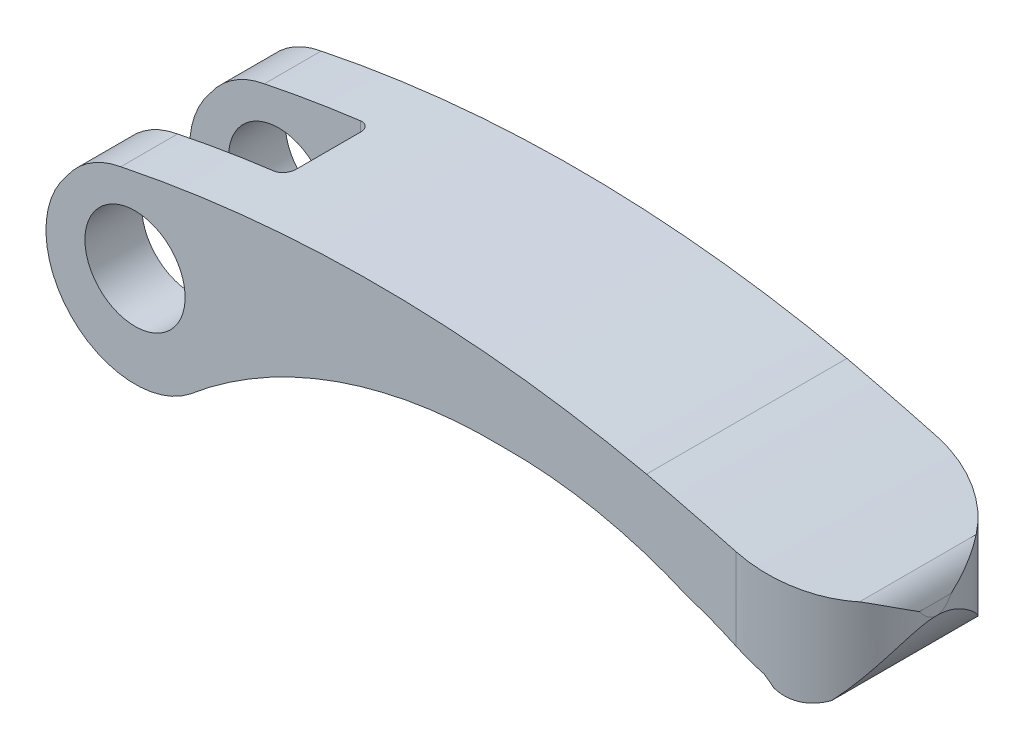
ISO-10303-21;
HEADER;
FILE_DESCRIPTION(('STEP AP214'),'2;1');
FILE_NAME('part.step','',(''),(''),'','','');
FILE_SCHEMA(('AUTOMOTIVE_DESIGN { 1 0 10303 214 1 1 1 1 }'));
ENDSEC;
DATA;
#1=APPLICATION_CONTEXT('core data for automotive mechanical design processes');
#2=APPLICATION_PROTOCOL_DEFINITION('international standard','automotive_design',2000,#1);
#3=PRODUCT_CONTEXT('',#1,'mechanical');
#4=PRODUCT('Part','Part','',(#3));
#5=PRODUCT_RELATED_PRODUCT_CATEGORY('part','',(#4));
#6=PRODUCT_DEFINITION_FORMATION('','',#4);
#7=PRODUCT_DEFINITION_CONTEXT('part definition',#1,'design');
#8=PRODUCT_DEFINITION('design','',#6,#7);
#9=PRODUCT_DEFINITION_SHAPE('','',#8);
#10=(LENGTH_UNIT() NAMED_UNIT(*) SI_UNIT(.MILLI.,.METRE.));
#11=(NAMED_UNIT(*) PLANE_ANGLE_UNIT() SI_UNIT($,.RADIAN.));
#12=(NAMED_UNIT(*) SI_UNIT($,.STERADIAN.) SOLID_ANGLE_UNIT());
#13=UNCERTAINTY_MEASURE_WITH_UNIT(LENGTH_MEASURE(1.E-05),#10,'distance_accuracy_value','');
#14=(GEOMETRIC_REPRESENTATION_CONTEXT(3) GLOBAL_UNCERTAINTY_ASSIGNED_CONTEXT((#13)) GLOBAL_UNIT_ASSIGNED_CONTEXT((#10,
#11,#12)) REPRESENTATION_CONTEXT('',''));
#15=CARTESIAN_POINT('',(0.,0.,0.));
#16=DIRECTION('',(0.,0.,1.));
#17=DIRECTION('',(1.,0.,0.));
#18=AXIS2_PLACEMENT_3D('',#15,#16,#17);
#19=CARTESIAN_POINT('',(49.9813614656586,-9.25441630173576,9.));
#20=DIRECTION('',(0.,0.,-1.));
#21=DIRECTION('',(-1.,0.,0.));
#22=AXIS2_PLACEMENT_3D('',#19,#20,#21);
#23=CYLINDRICAL_SURFACE('',#22,8.44721928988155);
#24=DIRECTION('',(0.,0.,-1.));
#25=VECTOR('',#24,1.);
#26=CARTESIAN_POINT('',(56.9117806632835,-4.42484039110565,9.));
#27=LINE('',#26,#25);
#28=CARTESIAN_POINT('',(56.9117806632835,-4.42484039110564,8.51595757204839));
#29=VERTEX_POINT('',#28);
#30=CARTESIAN_POINT('',(56.9117806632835,-4.42484039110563,-8.51595757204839));
#31=VERTEX_POINT('',#30);
#32=EDGE_CURVE('E374',#29,#31,#27,.T.);
#33=ORIENTED_EDGE('',*,*,#32,.F.);
#34=CARTESIAN_POINT('',(56.22613031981,-3.56597401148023,8.72034080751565));
#35=CARTESIAN_POINT('',(56.2880302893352,-3.63392767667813,8.70453904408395));
#36=CARTESIAN_POINT('',(56.3487729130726,-3.70283898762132,8.68833055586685));
#37=CARTESIAN_POINT('',(56.4678407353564,-3.84243815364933,8.65526287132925));
#38=CARTESIAN_POINT('',(56.5261684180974,-3.91312405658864,8.63840437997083));
#39=CARTESIAN_POINT('',(56.6404341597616,-4.05627700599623,8.60416555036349));
#40=CARTESIAN_POINT('',(56.6963722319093,-4.12874404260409,8.58678521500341));
#41=CARTESIAN_POINT('',(56.8058801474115,-4.2754758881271,8.55162832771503));
#42=CARTESIAN_POINT('',(56.8594474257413,-4.3497425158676,8.5338513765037));
#43=CARTESIAN_POINT('',(56.9117806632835,-4.42484039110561,8.51595757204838));
#44=B_SPLINE_CURVE_WITH_KNOTS('',3,(#34,#35,#36,#37,#38,#39,#40,#41,#42,#43),.UNSPECIFIED.,.F.,
.F.,(4,2,2,2,4),(0.,0.279790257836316,0.559285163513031,0.838778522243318,1.11856722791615),.UNSPECIFIED.);
#45=CARTESIAN_POINT('',(56.22613031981,-3.56597401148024,8.72034080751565));
#46=VERTEX_POINT('',#45);
#47=EDGE_CURVE('E292',#46,#29,#44,.T.);
#48=ORIENTED_EDGE('',*,*,#47,.F.);
#49=DIRECTION('',(0.,0.,-1.));
#50=VECTOR('',#49,1.);
#51=CARTESIAN_POINT('',(56.22613031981,-3.56597401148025,9.));
#52=LINE('',#51,#50);
#53=CARTESIAN_POINT('',(56.22613031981,-3.56597401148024,-8.72034080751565));
#54=VERTEX_POINT('',#53);
#55=EDGE_CURVE('E351',#46,#54,#52,.T.);
#56=ORIENTED_EDGE('',*,*,#55,.T.);
#57=CARTESIAN_POINT('',(56.9117806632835,-4.42484039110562,-8.51595757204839));
#58=CARTESIAN_POINT('',(56.8594474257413,-4.3497425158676,-8.53385137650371));
#59=CARTESIAN_POINT('',(56.8058801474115,-4.2754758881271,-8.55162832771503));
#60=CARTESIAN_POINT('',(56.6963722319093,-4.12874404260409,-8.58678521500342));
#61=CARTESIAN_POINT('',(56.6404341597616,-4.05627700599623,-8.6041655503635));
#62=CARTESIAN_POINT('',(56.5261684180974,-3.91312405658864,-8.63840437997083));
#63=CARTESIAN_POINT('',(56.4678407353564,-3.84243815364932,-8.65526287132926));
#64=CARTESIAN_POINT('',(56.3487729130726,-3.70283898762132,-8.68833055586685));
#65=CARTESIAN_POINT('',(56.2880302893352,-3.63392767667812,-8.70453904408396));
#66=CARTESIAN_POINT('',(56.22613031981,-3.56597401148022,-8.72034080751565));
#67=B_SPLINE_CURVE_WITH_KNOTS('',3,(#57,#58,#59,#60,#61,#62,#63,#64,#65,#66),.UNSPECIFIED.,.F.,
.F.,(4,2,2,2,4),(0.,0.279788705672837,0.559282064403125,0.838776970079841,1.11856722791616),.UNSPECIFIED.);
#68=EDGE_CURVE('E18',#31,#54,#67,.T.);
#69=ORIENTED_EDGE('',*,*,#68,.F.);
#70=EDGE_LOOP('',(#33,#48,#56,#69));
#71=FACE_BOUND('',#70,.T.);
#72=ADVANCED_FACE('F14',(#71),#23,.F.);
#73=CARTESIAN_POINT('',(63.,0.,9.));
#74=DIRECTION('',(-0.993149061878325,-0.116854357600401,0.));
#75=DIRECTION('',(0.116854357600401,-0.993149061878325,0.));
#76=AXIS2_PLACEMENT_3D('',#73,#74,#75);
#77=PLANE('',#76);
#78=CARTESIAN_POINT('',(54.,76.4912985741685,0.));
#79=DIRECTION('',(-0.993149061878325,-0.116854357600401,0.));
#80=DIRECTION('',(0.116854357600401,-0.993149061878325,0.));
#81=AXIS2_PLACEMENT_3D('',#78,#79,#80);
#82=ELLIPSE('',#81,77.0189506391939,9.);
#83=CARTESIAN_POINT('',(62.8855753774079,0.972498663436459,-1.43057688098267));
#84=VERTEX_POINT('',#83);
#85=CARTESIAN_POINT('',(63.,0.,0.));
#86=VERTEX_POINT('',#85);
#87=EDGE_CURVE('E356',#84,#86,#82,.T.);
#88=ORIENTED_EDGE('',*,*,#87,.F.);
#89=DIRECTION('',(0.,0.,-1.));
#90=VECTOR('',#89,1.);
#91=CARTESIAN_POINT('',(62.8855753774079,0.972498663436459,9.));
#92=LINE('',#91,#90);
#93=CARTESIAN_POINT('',(62.8855753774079,0.972498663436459,1.43057688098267));
#94=VERTEX_POINT('',#93);
#95=EDGE_CURVE('E366',#94,#84,#92,.T.);
#96=ORIENTED_EDGE('',*,*,#95,.F.);
#97=CARTESIAN_POINT('',(54.,76.4912985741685,0.));
#98=DIRECTION('',(-0.993149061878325,-0.116854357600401,0.));
#99=DIRECTION('',(0.116854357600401,-0.993149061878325,0.));
#100=AXIS2_PLACEMENT_3D('',#97,#98,#99);
#101=ELLIPSE('',#100,77.0189506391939,9.);
#102=EDGE_CURVE('E549',#86,#94,#101,.T.);
#103=ORIENTED_EDGE('',*,*,#102,.F.);
#104=EDGE_LOOP('',(#88,#96,#103));
#105=FACE_BOUND('',#104,.T.);
#106=ADVANCED_FACE('F550',(#105),#77,.F.);
#107=CARTESIAN_POINT('',(49.7035415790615,4.75137276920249,9.));
#108=DIRECTION('',(0.,0.,-1.));
#109=DIRECTION('',(-1.,0.,0.));
#110=AXIS2_PLACEMENT_3D('',#107,#108,#109);
#111=CYLINDRICAL_SURFACE('',#110,14.1198919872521);
#112=CARTESIAN_POINT('',(63.,0.,0.));
#113=CARTESIAN_POINT('',(63.0000267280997,0.000117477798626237,-0.110956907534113));
#114=CARTESIAN_POINT('',(62.9979493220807,-0.00573911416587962,-0.221828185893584));
#115=CARTESIAN_POINT('',(62.9898069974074,-0.0284547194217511,-0.44196657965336));
#116=CARTESIAN_POINT('',(62.9837540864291,-0.0452805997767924,-0.551237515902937));
#117=CARTESIAN_POINT('',(62.9680464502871,-0.0885386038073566,-0.765144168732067));
#118=CARTESIAN_POINT('',(62.9584703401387,-0.114760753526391,-0.869829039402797));
#119=CARTESIAN_POINT('',(62.93599936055,-0.175539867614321,-1.07643767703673));
#120=CARTESIAN_POINT('',(62.9231017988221,-0.210103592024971,-1.17835912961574));
#121=CARTESIAN_POINT('',(62.8876217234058,-0.303812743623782,-1.42554849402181));
#122=CARTESIAN_POINT('',(62.8633189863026,-0.366933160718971,-1.56905802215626));
#123=CARTESIAN_POINT('',(62.8090729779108,-0.50427677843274,-1.84950341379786));
#124=CARTESIAN_POINT('',(62.7791266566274,-0.578505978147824,-1.98643567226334));
#125=CARTESIAN_POINT('',(62.7138303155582,-0.735984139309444,-2.25578765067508));
#126=CARTESIAN_POINT('',(62.6784228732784,-0.819325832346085,-2.38813859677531));
#127=CARTESIAN_POINT('',(62.6028683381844,-0.992112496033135,-2.64743228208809));
#128=CARTESIAN_POINT('',(62.5627191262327,-1.08156018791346,-2.77437256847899));
#129=CARTESIAN_POINT('',(62.4739717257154,-1.27354813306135,-3.03521604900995));
#130=CARTESIAN_POINT('',(62.4249337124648,-1.37652711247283,-3.16864483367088));
#131=CARTESIAN_POINT('',(62.3217732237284,-1.58623438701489,-3.43043137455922));
#132=CARTESIAN_POINT('',(62.2676513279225,-1.69296225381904,-3.55878970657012));
#133=CARTESIAN_POINT('',(62.0977429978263,-2.01727327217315,-3.93742227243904));
#134=CARTESIAN_POINT('',(61.9744973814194,-2.23880004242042,-4.18101263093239));
#135=CARTESIAN_POINT('',(61.7090546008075,-2.68545895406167,-4.65223132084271));
#136=CARTESIAN_POINT('',(61.5669203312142,-2.91057703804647,-4.87990895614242));
#137=CARTESIAN_POINT('',(61.2633825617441,-3.36128284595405,-5.32117511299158));
#138=CARTESIAN_POINT('',(61.1019931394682,-3.58687010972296,-5.53477375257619));
#139=CARTESIAN_POINT('',(60.811375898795,-3.96792672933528,-5.88559206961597));
#140=CARTESIAN_POINT('',(60.6871788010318,-4.12397275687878,-6.02637765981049));
#141=CARTESIAN_POINT('',(60.4292706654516,-4.43397973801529,-6.30077747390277));
#142=CARTESIAN_POINT('',(60.2955725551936,-4.5879431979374,-6.43440102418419));
#143=CARTESIAN_POINT('',(60.1569711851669,-4.74057956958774,-6.56442730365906));
#144=B_SPLINE_CURVE_WITH_KNOTS('',3,(#112,#113,#114,#115,#116,#117,#118,#119,#120,#121,#122,
#123,#124,#125,#126,#127,#128,#129,#130,#131,#132,#133,#134,#135,#136,#137,#138,#139,#140,#141,
#142,#143),.UNSPECIFIED.,.F.,.F.,(4,2,2,2,2,2,2,2,2,2,2,2,2,2,2,4),(0.,0.332560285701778,
0.664120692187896,0.988691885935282,1.31352700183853,1.78862696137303,2.26398442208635,
2.74473198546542,3.22569521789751,3.75207544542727,4.27839572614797,5.33197739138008,
6.3821349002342,7.4315292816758,8.16361869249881,8.89473038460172),.UNSPECIFIED.);
#145=CARTESIAN_POINT('',(60.1569711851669,-4.74057956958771,-6.56442730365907));
#146=VERTEX_POINT('',#145);
#147=EDGE_CURVE('E315',#86,#146,#144,.T.);
#148=ORIENTED_EDGE('',*,*,#147,.F.);
#149=CARTESIAN_POINT('',(60.1569711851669,-4.74057956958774,6.56442730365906));
#150=CARTESIAN_POINT('',(60.2648988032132,-4.62172155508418,6.46318876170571));
#151=CARTESIAN_POINT('',(60.3698570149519,-4.50205633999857,6.35975166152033));
#152=CARTESIAN_POINT('',(60.5738919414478,-4.26149017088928,6.14862005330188));
#153=CARTESIAN_POINT('',(60.672969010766,-4.14058929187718,6.04092580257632));
#154=CARTESIAN_POINT('',(60.8654211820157,-3.89777824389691,5.82128271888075));
#155=CARTESIAN_POINT('',(60.9587896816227,-3.77586708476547,5.70932919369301));
#156=CARTESIAN_POINT('',(61.1397517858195,-3.53159614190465,5.48134230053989));
#157=CARTESIAN_POINT('',(61.2273453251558,-3.40923635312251,5.36530888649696));
#158=CARTESIAN_POINT('',(61.4824668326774,-3.04078212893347,5.009811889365));
#159=CARTESIAN_POINT('',(61.6413330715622,-2.79458751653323,4.76409680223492));
#160=CARTESIAN_POINT('',(61.8623108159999,-2.4288794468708,4.38242055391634));
#161=CARTESIAN_POINT('',(61.9330682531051,-2.30760268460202,4.2530437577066));
#162=CARTESIAN_POINT('',(62.0688108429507,-2.06702226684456,3.98952049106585));
#163=CARTESIAN_POINT('',(62.1337968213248,-1.94771833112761,3.85537470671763));
#164=CARTESIAN_POINT('',(62.2480848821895,-1.73078334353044,3.6034803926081));
#165=CARTESIAN_POINT('',(62.2982410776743,-1.63271166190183,3.48649863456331));
#166=CARTESIAN_POINT('',(62.3943070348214,-1.43954423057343,3.24839835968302));
#167=CARTESIAN_POINT('',(62.4402169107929,-1.34444840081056,3.12727995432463));
#168=CARTESIAN_POINT('',(62.5276913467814,-1.15820564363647,2.88022280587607));
#169=CARTESIAN_POINT('',(62.5692501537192,-1.06706403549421,2.75427797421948));
#170=CARTESIAN_POINT('',(62.6476861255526,-0.890420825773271,2.49711281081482));
#171=CARTESIAN_POINT('',(62.6845640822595,-0.804918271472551,2.36589337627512));
#172=CARTESIAN_POINT('',(62.7722898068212,-0.596332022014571,2.02320972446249));
#173=CARTESIAN_POINT('',(62.8195970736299,-0.478588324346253,1.80746967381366));
#174=CARTESIAN_POINT('',(62.8994452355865,-0.273723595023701,1.3604234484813));
#175=CARTESIAN_POINT('',(62.9320909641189,-0.186386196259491,1.12924181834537));
#176=CARTESIAN_POINT('',(62.9701104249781,-0.0830114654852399,0.746989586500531));
#177=CARTESIAN_POINT('',(62.9811652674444,-0.0524340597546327,0.600504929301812));
#178=CARTESIAN_POINT('',(62.9923858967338,-0.0212660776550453,0.37765647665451));
#179=CARTESIAN_POINT('',(62.9952330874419,-0.0133240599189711,0.302421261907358));
#180=CARTESIAN_POINT('',(62.999043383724,-0.00267773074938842,0.151466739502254));
#181=CARTESIAN_POINT('',(63.000004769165,2.17987379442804E-05,0.0757470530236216));
#182=CARTESIAN_POINT('',(63.,0.,0.));
#183=B_SPLINE_CURVE_WITH_KNOTS('',3,(#149,#150,#151,#152,#153,#154,#155,#156,#157,#158,#159,
#160,#161,#162,#163,#164,#165,#166,#167,#168,#169,#170,#171,#172,#173,#174,#175,#176,#177,#178,
#179,#180,#181,#182),.UNSPECIFIED.,.F.,.F.,(4,2,2,2,2,2,2,2,2,2,2,2,2,2,2,2,4),(0.,
0.569352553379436,1.13867074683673,1.70863540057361,2.27860649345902,3.42449115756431,
3.99715922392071,4.5697452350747,5.05167084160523,5.53358347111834,6.01612545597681,
6.49858570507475,7.24763397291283,7.99123760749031,8.43996362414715,8.6668942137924,
8.89403170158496),.UNSPECIFIED.);
#184=CARTESIAN_POINT('',(60.1569711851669,-4.74057956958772,6.56442730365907));
#185=VERTEX_POINT('',#184);
#186=EDGE_CURVE('E278',#185,#86,#183,.T.);
#187=ORIENTED_EDGE('',*,*,#186,.F.);
#188=DIRECTION('',(0.,0.,-1.));
#189=VECTOR('',#188,1.);
#190=CARTESIAN_POINT('',(60.1569711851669,-4.74057956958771,9.));
#191=LINE('',#190,#189);
#192=EDGE_CURVE('E368',#146,#185,#191,.F.);
#193=ORIENTED_EDGE('',*,*,#192,.F.);
#194=EDGE_LOOP('',(#148,#187,#193));
#195=FACE_BOUND('',#194,.T.);
#196=ADVANCED_FACE('F302',(#195),#111,.T.);
#197=CARTESIAN_POINT('',(58.7820309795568,-2.03729308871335,9.));
#198=DIRECTION('',(0.,0.,-1.));
#199=DIRECTION('',(-1.,0.,0.));
#200=AXIS2_PLACEMENT_3D('',#197,#198,#199);
#201=CYLINDRICAL_SURFACE('',#200,3.03285646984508);
#202=ORIENTED_EDGE('',*,*,#192,.T.);
#203=CARTESIAN_POINT('',(56.9117806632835,-4.42484039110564,8.51595757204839));
#204=CARTESIAN_POINT('',(56.9794883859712,-4.47789832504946,8.49281615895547));
#205=CARTESIAN_POINT('',(57.0491243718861,-4.52777886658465,8.46809551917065));
#206=CARTESIAN_POINT('',(57.1914560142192,-4.62099135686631,8.41548101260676));
#207=CARTESIAN_POINT('',(57.2641500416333,-4.66432673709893,8.38758882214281));
#208=CARTESIAN_POINT('',(57.4114518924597,-4.74408286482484,8.32876062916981));
#209=CARTESIAN_POINT('',(57.4860464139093,-4.78054169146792,8.29784292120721));
#210=CARTESIAN_POINT('',(57.6367927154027,-4.8468189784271,8.23289096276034));
#211=CARTESIAN_POINT('',(57.7129446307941,-4.87663685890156,8.19885644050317));
#212=CARTESIAN_POINT('',(57.9424032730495,-4.9560860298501,8.09232440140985));
#213=CARTESIAN_POINT('',(58.0970942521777,-4.99591520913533,8.01524827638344));
#214=CARTESIAN_POINT('',(58.4050762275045,-5.05071083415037,7.85022043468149));
#215=CARTESIAN_POINT('',(58.5583652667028,-5.06564662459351,7.76225545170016));
#216=CARTESIAN_POINT('',(58.8741600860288,-5.07324306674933,7.56835917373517));
#217=CARTESIAN_POINT('',(59.0361529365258,-5.06364638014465,7.46151464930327));
#218=CARTESIAN_POINT('',(59.3507814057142,-5.02057826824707,7.23921985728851));
#219=CARTESIAN_POINT('',(59.5034119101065,-4.98709391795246,7.12376496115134));
#220=CARTESIAN_POINT('',(59.7392059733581,-4.91664154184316,6.93358396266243));
#221=CARTESIAN_POINT('',(59.8259954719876,-4.88627357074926,6.86078317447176));
#222=CARTESIAN_POINT('',(59.99492442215,-4.81854048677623,6.7136727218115));
#223=CARTESIAN_POINT('',(60.0770783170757,-4.78119887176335,6.6393688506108));
#224=CARTESIAN_POINT('',(60.1569711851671,-4.74057956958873,6.56442730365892));
#225=B_SPLINE_CURVE_WITH_KNOTS('',3,(#203,#204,#205,#206,#207,#208,#209,#210,#211,#212,#213,
#214,#215,#216,#217,#218,#219,#220,#221,#222,#223,#224),.UNSPECIFIED.,.F.,.F.,(4,2,2,2,2,2,2,2,
2,2,4),(0.,0.267120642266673,0.534100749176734,0.799556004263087,1.06503442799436,
1.59463706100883,2.12489139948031,2.70565511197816,3.28673329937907,3.63829322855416,
3.98868926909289),.UNSPECIFIED.);
#226=EDGE_CURVE('E285',#29,#185,#225,.T.);
#227=ORIENTED_EDGE('',*,*,#226,.F.);
#228=ORIENTED_EDGE('',*,*,#32,.T.);
#229=CARTESIAN_POINT('',(60.1569711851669,-4.74057956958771,-6.56442730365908));
#230=CARTESIAN_POINT('',(60.0693558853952,-4.78512508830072,-6.64662261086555));
#231=CARTESIAN_POINT('',(59.9789806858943,-4.82574523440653,-6.72807214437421));
#232=CARTESIAN_POINT('',(59.7928861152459,-4.89848441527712,-6.88894485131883));
#233=CARTESIAN_POINT('',(59.6971585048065,-4.93058988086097,-6.96836461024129));
#234=CARTESIAN_POINT('',(59.5001551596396,-4.9856880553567,-7.12490213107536));
#235=CARTESIAN_POINT('',(59.3988464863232,-5.00861812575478,-7.20200085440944));
#236=CARTESIAN_POINT('',(59.1919343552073,-5.04415521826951,-7.35256410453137));
#237=CARTESIAN_POINT('',(59.0863339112,-5.05676935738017,-7.42603110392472));
#238=CARTESIAN_POINT('',(58.8143342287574,-5.07445101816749,-7.60664557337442));
#239=CARTESIAN_POINT('',(58.6454383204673,-5.07194958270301,-7.71095193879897));
#240=CARTESIAN_POINT('',(58.3038123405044,-5.03711095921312,-7.90669554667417));
#241=CARTESIAN_POINT('',(58.1310943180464,-5.00485726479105,-7.99816797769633));
#242=CARTESIAN_POINT('',(57.8071297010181,-4.91352546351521,-8.1568648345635));
#243=CARTESIAN_POINT('',(57.6556915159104,-4.85794635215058,-8.22566688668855));
#244=CARTESIAN_POINT('',(57.4338549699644,-4.75525287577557,-8.3195639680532));
#245=CARTESIAN_POINT('',(57.3608178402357,-4.717815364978,-8.34930429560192));
#246=CARTESIAN_POINT('',(57.2171599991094,-4.63656011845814,-8.40570115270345));
#247=CARTESIAN_POINT('',(57.146537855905,-4.59274624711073,-8.43235953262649));
#248=CARTESIAN_POINT('',(57.0493097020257,-4.52668248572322,-8.46773961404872));
#249=CARTESIAN_POINT('',(57.0213852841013,-4.50701319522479,-8.47774094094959));
#250=CARTESIAN_POINT('',(56.9661336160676,-4.4666762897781,-8.49722938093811));
#251=CARTESIAN_POINT('',(56.9388057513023,-4.44600978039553,-8.50671703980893));
#252=CARTESIAN_POINT('',(56.9117806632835,-4.42484039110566,-8.5159575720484));
#253=B_SPLINE_CURVE_WITH_KNOTS('',3,(#229,#230,#231,#232,#233,#234,#235,#236,#237,#238,#239,
#240,#241,#242,#243,#244,#245,#246,#247,#248,#249,#250,#251,#252),.UNSPECIFIED.,.F.,.F.,(4,2,2,
2,2,2,2,2,2,2,2,4),(0.,0.384356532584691,0.769321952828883,1.15687236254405,1.54415517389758,
2.13717775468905,2.72854118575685,3.25211147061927,3.51373609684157,3.77520282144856,
3.88195639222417,3.98859421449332),.UNSPECIFIED.);
#254=EDGE_CURVE('E307',#146,#31,#253,.T.);
#255=ORIENTED_EDGE('',*,*,#254,.F.);
#256=EDGE_LOOP('',(#202,#227,#228,#255));
#257=FACE_BOUND('',#256,.T.);
#258=ADVANCED_FACE('F297',(#257),#201,.T.);
#259=CARTESIAN_POINT('',(0.,0.,18.));
#260=DIRECTION('',(0.,0.,-1.));
#261=DIRECTION('',(-1.,0.,0.));
#262=AXIS2_PLACEMENT_3D('',#259,#260,#261);
#263=CYLINDRICAL_SURFACE('',#262,4.5);
#264=CARTESIAN_POINT('',(0.,0.,3.9));
#265=DIRECTION('',(0.,0.,-1.));
#266=DIRECTION('',(-1.,0.,0.));
#267=AXIS2_PLACEMENT_3D('',#264,#265,#266);
#268=CIRCLE('',#267,4.5);
#269=CARTESIAN_POINT('',(-4.5,0.,3.9));
#270=VERTEX_POINT('',#269);
#271=EDGE_CURVE('E197',#270,#270,#268,.T.);
#272=ORIENTED_EDGE('',*,*,#271,.T.);
#273=EDGE_LOOP('',(#272));
#274=FACE_BOUND('',#273,.T.);
#275=CARTESIAN_POINT('',(0.,0.,9.));
#276=DIRECTION('',(0.,0.,-1.));
#277=DIRECTION('',(-1.,0.,0.));
#278=AXIS2_PLACEMENT_3D('',#275,#276,#277);
#279=CIRCLE('',#278,4.5);
#280=CARTESIAN_POINT('',(-4.5,0.,9.));
#281=VERTEX_POINT('',#280);
#282=EDGE_CURVE('E163',#281,#281,#279,.T.);
#283=ORIENTED_EDGE('',*,*,#282,.F.);
#284=EDGE_LOOP('',(#283));
#285=FACE_BOUND('',#284,.T.);
#286=ADVANCED_FACE('F301',(#274,#285),#263,.F.);
#287=CARTESIAN_POINT('',(0.000156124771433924,-0.999995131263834,9.));
#288=DIRECTION('',(0.,0.,-1.));
#289=DIRECTION('',(-1.,0.,0.));
#290=AXIS2_PLACEMENT_3D('',#287,#288,#289);
#291=CYLINDRICAL_SURFACE('',#290,8.);
#292=DIRECTION('',(0.,0.,-1.));
#293=VECTOR('',#292,1.);
#294=CARTESIAN_POINT('',(4.96664216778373,-7.27167882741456,9.));
#295=LINE('',#294,#293);
#296=CARTESIAN_POINT('',(4.96664216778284,-7.27167882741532,3.9));
#297=VERTEX_POINT('',#296);
#298=CARTESIAN_POINT('',(4.96664216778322,-7.271678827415,9.));
#299=VERTEX_POINT('',#298);
#300=EDGE_CURVE('E365',#297,#299,#295,.F.);
#301=ORIENTED_EDGE('',*,*,#300,.T.);
#302=CARTESIAN_POINT('',(0.000156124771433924,-0.999995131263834,9.));
#303=DIRECTION('',(0.,0.,-1.));
#304=DIRECTION('',(-1.,0.,0.));
#305=AXIS2_PLACEMENT_3D('',#302,#303,#304);
#306=CIRCLE('',#305,8.);
#307=CARTESIAN_POINT('',(-6.09273550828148,4.18427642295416,9.));
#308=VERTEX_POINT('',#307);
#309=EDGE_CURVE('E175',#308,#299,#306,.F.);
#310=ORIENTED_EDGE('',*,*,#309,.F.);
#311=DIRECTION('',(0.,0.,-1.));
#312=VECTOR('',#311,1.);
#313=CARTESIAN_POINT('',(-6.09273550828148,4.18427642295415,9.));
#314=LINE('',#313,#312);
#315=CARTESIAN_POINT('',(-6.09273550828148,4.18427642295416,3.9));
#316=VERTEX_POINT('',#315);
#317=EDGE_CURVE('E191',#316,#308,#314,.F.);
#318=ORIENTED_EDGE('',*,*,#317,.F.);
#319=CARTESIAN_POINT('',(0.000156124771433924,-0.999995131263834,3.9));
#320=DIRECTION('',(0.,0.,-1.));
#321=DIRECTION('',(-1.,0.,0.));
#322=AXIS2_PLACEMENT_3D('',#319,#320,#321);
#323=CIRCLE('',#322,8.);
#324=EDGE_CURVE('E133',#316,#297,#323,.F.);
#325=ORIENTED_EDGE('',*,*,#324,.T.);
#326=EDGE_LOOP('',(#301,#310,#318,#325));
#327=FACE_BOUND('',#326,.T.);
#328=ADVANCED_FACE('F510',(#327),#291,.T.);
#329=CARTESIAN_POINT('',(59.9754791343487,0.140510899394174,9.));
#330=DIRECTION('',(0.,0.,-1.));
#331=DIRECTION('',(-1.,0.,0.));
#332=AXIS2_PLACEMENT_3D('',#329,#330,#331);
#333=CYLINDRICAL_SURFACE('',#332,3.02669188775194);
#334=DIRECTION('',(0.,0.,-1.));
#335=VECTOR('',#334,1.);
#336=CARTESIAN_POINT('',(61.3171374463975,2.8535934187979,9.));
#337=LINE('',#336,#335);
#338=CARTESIAN_POINT('',(61.3171374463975,2.85359341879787,5.24018125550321));
#339=VERTEX_POINT('',#338);
#340=CARTESIAN_POINT('',(61.3171374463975,2.85359341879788,-5.24018125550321));
#341=VERTEX_POINT('',#340);
#342=EDGE_CURVE('E170',#339,#341,#337,.T.);
#343=ORIENTED_EDGE('',*,*,#342,.F.);
#344=CARTESIAN_POINT('',(62.8855753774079,0.972498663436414,1.43057688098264));
#345=CARTESIAN_POINT('',(62.8497139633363,1.09787880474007,1.65311426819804));
#346=CARTESIAN_POINT('',(62.8054396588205,1.22211335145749,1.87502386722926));
#347=CARTESIAN_POINT('',(62.6995216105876,1.46650183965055,2.31738970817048));
#348=CARTESIAN_POINT('',(62.637851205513,1.58664919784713,2.5378431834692));
#349=CARTESIAN_POINT('',(62.49810902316,1.81834721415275,2.9720470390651));
#350=CARTESIAN_POINT('',(62.4203879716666,1.9300213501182,3.18584351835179));
#351=CARTESIAN_POINT('',(62.2473450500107,2.14513949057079,3.61023446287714));
#352=CARTESIAN_POINT('',(62.1520367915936,2.24858977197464,3.82083126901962));
#353=CARTESIAN_POINT('',(61.9446195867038,2.44340091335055,4.2350774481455));
#354=CARTESIAN_POINT('',(61.8327675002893,2.53491214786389,4.43878296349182));
#355=CARTESIAN_POINT('',(61.6507302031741,2.66240606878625,4.74134671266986));
#356=CARTESIAN_POINT('',(61.5873275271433,2.70345229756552,4.84218989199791));
#357=CARTESIAN_POINT('',(61.4557910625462,2.78160636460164,5.04237297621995));
#358=CARTESIAN_POINT('',(61.3876551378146,2.81871240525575,5.14171217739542));
#359=CARTESIAN_POINT('',(61.3171374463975,2.85359341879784,5.24018125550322));
#360=B_SPLINE_CURVE_WITH_KNOTS('',3,(#344,#345,#346,#347,#348,#349,#350,#351,#352,#353,#354,
#355,#356,#357,#358,#359),.UNSPECIFIED.,.F.,.F.,(4,2,2,2,2,2,2,4),(0.,0.773764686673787,
1.54872175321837,2.30826061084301,3.06721406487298,3.81542648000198,4.19326204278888,
4.57126924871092),.UNSPECIFIED.);
#361=EDGE_CURVE('E152',#94,#339,#360,.T.);
#362=ORIENTED_EDGE('',*,*,#361,.F.);
#363=ORIENTED_EDGE('',*,*,#95,.T.);
#364=CARTESIAN_POINT('',(61.3171374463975,2.85359341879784,-5.24018125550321));
#365=CARTESIAN_POINT('',(61.3802004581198,2.82240209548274,-5.15212215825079));
#366=CARTESIAN_POINT('',(61.4413601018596,2.78942759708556,-5.063364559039));
#367=CARTESIAN_POINT('',(61.5598970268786,2.72027778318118,-4.88461435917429));
#368=CARTESIAN_POINT('',(61.6172753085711,2.68410332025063,-4.79462209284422));
#369=CARTESIAN_POINT('',(61.7836655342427,2.57140847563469,-4.52322283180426));
#370=CARTESIAN_POINT('',(61.8871118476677,2.49062594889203,-4.3401423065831));
#371=CARTESIAN_POINT('',(62.0779459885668,2.32145133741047,-3.97351744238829));
#372=CARTESIAN_POINT('',(62.1655599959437,2.23319828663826,-3.79002529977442));
#373=CARTESIAN_POINT('',(62.3271338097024,2.04983468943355,-3.42045672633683));
#374=CARTESIAN_POINT('',(62.4010904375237,1.95472255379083,-3.23437970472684));
#375=CARTESIAN_POINT('',(62.5636718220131,1.71859249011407,-2.78256725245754));
#376=CARTESIAN_POINT('',(62.6456530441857,1.57489984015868,-2.51581049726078));
#377=CARTESIAN_POINT('',(62.7497539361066,1.3533657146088,-2.11220495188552));
#378=CARTESIAN_POINT('',(62.7814334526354,1.27807934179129,-1.9763139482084));
#379=CARTESIAN_POINT('',(62.8383282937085,1.12617637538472,-1.70390289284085));
#380=CARTESIAN_POINT('',(62.8635429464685,1.04955964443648,-1.56738277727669));
#381=CARTESIAN_POINT('',(62.8855753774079,0.972498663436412,-1.43057688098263));
#382=B_SPLINE_CURVE_WITH_KNOTS('',3,(#364,#365,#366,#367,#368,#369,#370,#371,#372,#373,#374,
#375,#376,#377,#378,#379,#380,#381),.UNSPECIFIED.,.F.,.F.,(4,2,2,2,2,2,2,2,4),(0.,
0.338063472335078,0.676037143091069,1.35102365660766,2.01543605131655,2.68000288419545,
3.62027428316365,4.0958120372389,4.57139918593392),.UNSPECIFIED.);
#383=EDGE_CURVE('E337',#341,#84,#382,.T.);
#384=ORIENTED_EDGE('',*,*,#383,.F.);
#385=EDGE_LOOP('',(#343,#362,#363,#384));
#386=FACE_BOUND('',#385,.T.);
#387=ADVANCED_FACE('F255',(#386),#333,.T.);
#388=CARTESIAN_POINT('',(54.,15.75,0.));
#389=DIRECTION('',(0.,-1.,0.));
#390=DIRECTION('',(0.,0.,-1.));
#391=AXIS2_PLACEMENT_3D('',#388,#389,#390);
#392=CYLINDRICAL_SURFACE('',#391,9.);
#393=CARTESIAN_POINT('',(54.,4.96493342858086,9.));
#394=CARTESIAN_POINT('',(54.261594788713,4.89424655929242,9.00002182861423));
#395=CARTESIAN_POINT('',(54.5230523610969,4.82307785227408,8.98859569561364));
#396=CARTESIAN_POINT('',(55.0438651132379,4.68030745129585,8.94307376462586));
#397=CARTESIAN_POINT('',(55.3032203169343,4.60870576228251,8.90897822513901));
#398=CARTESIAN_POINT('',(55.8181743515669,4.46555176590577,8.81831416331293));
#399=CARTESIAN_POINT('',(56.0737706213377,4.39399952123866,8.76173099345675));
#400=CARTESIAN_POINT('',(56.5792290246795,4.25155061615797,8.62647173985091));
#401=CARTESIAN_POINT('',(56.8290913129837,4.18065393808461,8.54779625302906));
#402=CARTESIAN_POINT('',(57.3215338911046,4.04002628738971,8.36875805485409));
#403=CARTESIAN_POINT('',(57.5641075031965,3.97029640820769,8.26837610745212));
#404=CARTESIAN_POINT('',(58.0399794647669,3.83266288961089,8.04658210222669));
#405=CARTESIAN_POINT('',(58.2732778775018,3.76475923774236,7.9251701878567));
#406=CARTESIAN_POINT('',(58.728584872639,3.63146970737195,7.66221147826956));
#407=CARTESIAN_POINT('',(58.9506077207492,3.566080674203,7.52069103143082));
#408=CARTESIAN_POINT('',(59.3818984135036,3.43837239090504,7.2183495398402));
#409=CARTESIAN_POINT('',(59.5911691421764,3.3760524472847,7.05753288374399));
#410=CARTESIAN_POINT('',(60.0788324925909,3.23010160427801,6.64731280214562));
#411=CARTESIAN_POINT('',(60.3501652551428,3.14827357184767,6.38871593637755));
#412=CARTESIAN_POINT('',(60.7321537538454,3.03237562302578,5.97606554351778));
#413=CARTESIAN_POINT('',(60.8553501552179,2.99487277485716,5.83434034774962));
#414=CARTESIAN_POINT('',(61.0929571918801,2.9223334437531,5.54303729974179));
#415=CARTESIAN_POINT('',(61.2073652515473,2.88729768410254,5.39345716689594));
#416=CARTESIAN_POINT('',(61.3171374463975,2.85359341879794,5.24018125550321));
#417=B_SPLINE_CURVE_WITH_KNOTS('',3,(#393,#394,#395,#396,#397,#398,#399,#400,#401,#402,#403,
#404,#405,#406,#407,#408,#409,#410,#411,#412,#413,#414,#415,#416),.UNSPECIFIED.,.F.,.F.,(4,2,2,
2,2,2,2,2,2,2,2,4),(0.,0.812680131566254,1.62535099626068,2.43855207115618,3.25173117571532,
4.06563388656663,4.87953104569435,5.69237141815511,6.50502727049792,7.65262022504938,
8.22678352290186,8.80111445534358),.UNSPECIFIED.);
#418=CARTESIAN_POINT('',(54.,4.96493342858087,9.));
#419=VERTEX_POINT('',#418);
#420=EDGE_CURVE('E239',#419,#339,#417,.T.);
#421=ORIENTED_EDGE('',*,*,#420,.F.);
#422=DIRECTION('',(0.,1.,0.));
#423=VECTOR('',#422,1.);
#424=CARTESIAN_POINT('',(54.,-2.05564731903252E-13,9.));
#425=LINE('',#424,#423);
#426=CARTESIAN_POINT('',(54.,-2.38889955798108,9.));
#427=VERTEX_POINT('',#426);
#428=EDGE_CURVE('E162',#427,#419,#425,.T.);
#429=ORIENTED_EDGE('',*,*,#428,.F.);
#430=CARTESIAN_POINT('',(54.,-2.38889955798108,9.));
#431=CARTESIAN_POINT('',(54.1912803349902,-2.48026906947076,9.00000285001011));
#432=CARTESIAN_POINT('',(54.3815939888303,-2.57361162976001,8.99390253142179));
#433=CARTESIAN_POINT('',(54.7590428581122,-2.76355486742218,8.96992078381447));
#434=CARTESIAN_POINT('',(54.9461865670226,-2.86014362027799,8.95207877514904));
#435=CARTESIAN_POINT('',(55.3173284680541,-3.05650239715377,8.9050346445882));
#436=CARTESIAN_POINT('',(55.5013267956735,-3.15627228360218,8.87583301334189));
#437=CARTESIAN_POINT('',(55.8662962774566,-3.35894398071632,8.80633640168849));
#438=CARTESIAN_POINT('',(56.0472552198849,-3.46185516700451,8.76600457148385));
#439=CARTESIAN_POINT('',(56.22613031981,-3.56597401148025,8.72034080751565));
#440=B_SPLINE_CURVE_WITH_KNOTS('',3,(#430,#431,#432,#433,#434,#435,#436,#437,#438,#439),
.UNSPECIFIED.,.F.,.F.,(4,2,2,2,4),(0.,0.635816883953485,1.26950995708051,1.90317566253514,
2.53896500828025),.UNSPECIFIED.);
#441=EDGE_CURVE('E151',#427,#46,#440,.T.);
#442=ORIENTED_EDGE('',*,*,#441,.T.);
#443=ORIENTED_EDGE('',*,*,#47,.T.);
#444=ORIENTED_EDGE('',*,*,#226,.T.);
#445=ORIENTED_EDGE('',*,*,#186,.T.);
#446=ORIENTED_EDGE('',*,*,#102,.T.);
#447=ORIENTED_EDGE('',*,*,#361,.T.);
#448=EDGE_LOOP('',(#421,#429,#442,#443,#444,#445,#446,#447));
#449=FACE_BOUND('',#448,.T.);
#450=ADVANCED_FACE('F250',(#449),#392,.T.);
#451=CARTESIAN_POINT('',(33.6338647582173,-37.3511876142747,9.));
#452=DIRECTION('',(0.,0.,-1.));
#453=DIRECTION('',(-1.,0.,0.));
#454=AXIS2_PLACEMENT_3D('',#451,#452,#453);
#455=CYLINDRICAL_SURFACE('',#454,40.);
#456=DIRECTION('',(0.,0.,-1.));
#457=VECTOR('',#456,1.);
#458=CARTESIAN_POINT('',(49.6739121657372,-0.708086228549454,9.));
#459=LINE('',#458,#457);
#460=CARTESIAN_POINT('',(49.6739121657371,-0.70808622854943,-9.));
#461=VERTEX_POINT('',#460);
#462=CARTESIAN_POINT('',(49.6739121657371,-0.708086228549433,9.));
#463=VERTEX_POINT('',#462);
#464=EDGE_CURVE('E140',#461,#463,#459,.F.);
#465=ORIENTED_EDGE('',*,*,#464,.T.);
#466=CARTESIAN_POINT('',(33.6338647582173,-37.3511876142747,9.));
#467=DIRECTION('',(0.,0.,-1.));
#468=DIRECTION('',(-1.,0.,0.));
#469=AXIS2_PLACEMENT_3D('',#466,#467,#468);
#470=CIRCLE('',#469,40.);
#471=CARTESIAN_POINT('',(33.0149119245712,2.64402331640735,9.));
#472=VERTEX_POINT('',#471);
#473=EDGE_CURVE('E145',#472,#463,#470,.T.);
#474=ORIENTED_EDGE('',*,*,#473,.F.);
#475=DIRECTION('',(0.,0.,-1.));
#476=VECTOR('',#475,1.);
#477=CARTESIAN_POINT('',(33.0149119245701,2.64402331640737,9.));
#478=LINE('',#477,#476);
#479=CARTESIAN_POINT('',(33.0149119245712,2.64402331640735,-9.));
#480=VERTEX_POINT('',#479);
#481=EDGE_CURVE('E362',#472,#480,#478,.T.);
#482=ORIENTED_EDGE('',*,*,#481,.T.);
#483=CARTESIAN_POINT('',(33.6338647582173,-37.3511876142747,-9.));
#484=DIRECTION('',(0.,0.,-1.));
#485=DIRECTION('',(-1.,0.,0.));
#486=AXIS2_PLACEMENT_3D('',#483,#484,#485);
#487=CIRCLE('',#486,40.);
#488=EDGE_CURVE('E148',#480,#461,#487,.T.);
#489=ORIENTED_EDGE('',*,*,#488,.T.);
#490=EDGE_LOOP('',(#465,#474,#482,#489));
#491=FACE_BOUND('',#490,.T.);
#492=ADVANCED_FACE('F142',(#491),#455,.F.);
#493=CARTESIAN_POINT('',(40.6660947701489,-30.3001254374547,9.));
#494=DIRECTION('',(0.,0.,-1.));
#495=DIRECTION('',(-1.,0.,0.));
#496=AXIS2_PLACEMENT_3D('',#493,#494,#495);
#497=CYLINDRICAL_SURFACE('',#496,30.9326616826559);
#498=ORIENTED_EDGE('',*,*,#55,.F.);
#499=ORIENTED_EDGE('',*,*,#441,.F.);
#500=CARTESIAN_POINT('',(40.6660947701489,-30.3001254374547,9.));
#501=DIRECTION('',(0.,0.,-1.));
#502=DIRECTION('',(-1.,0.,0.));
#503=AXIS2_PLACEMENT_3D('',#500,#501,#502);
#504=CIRCLE('',#503,30.9326616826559);
#505=EDGE_CURVE('E155',#463,#427,#504,.T.);
#506=ORIENTED_EDGE('',*,*,#505,.F.);
#507=ORIENTED_EDGE('',*,*,#464,.F.);
#508=CARTESIAN_POINT('',(40.6660947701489,-30.3001254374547,-9.));
#509=DIRECTION('',(0.,0.,-1.));
#510=DIRECTION('',(-1.,0.,0.));
#511=AXIS2_PLACEMENT_3D('',#508,#509,#510);
#512=CIRCLE('',#511,30.9326616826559);
#513=CARTESIAN_POINT('',(54.,-2.38889955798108,-9.));
#514=VERTEX_POINT('',#513);
#515=EDGE_CURVE('E406',#461,#514,#512,.T.);
#516=ORIENTED_EDGE('',*,*,#515,.T.);
#517=CARTESIAN_POINT('',(56.22613031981,-3.56597401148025,-8.72034080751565));
#518=CARTESIAN_POINT('',(56.0472552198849,-3.46185516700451,-8.76600457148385));
#519=CARTESIAN_POINT('',(55.8662962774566,-3.35894398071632,-8.80633640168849));
#520=CARTESIAN_POINT('',(55.5013267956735,-3.15627228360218,-8.87583301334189));
#521=CARTESIAN_POINT('',(55.3173284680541,-3.05650239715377,-8.9050346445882));
#522=CARTESIAN_POINT('',(54.9461865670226,-2.86014362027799,-8.95207877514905));
#523=CARTESIAN_POINT('',(54.7590428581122,-2.76355486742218,-8.96992078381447));
#524=CARTESIAN_POINT('',(54.3815939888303,-2.57361162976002,-8.99390253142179));
#525=CARTESIAN_POINT('',(54.1912803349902,-2.48026906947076,-9.00000285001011));
#526=CARTESIAN_POINT('',(54.,-2.38889955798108,-9.));
#527=B_SPLINE_CURVE_WITH_KNOTS('',3,(#517,#518,#519,#520,#521,#522,#523,#524,#525,#526),
.UNSPECIFIED.,.F.,.F.,(4,2,2,2,4),(0.,0.635789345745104,1.26945505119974,1.90314812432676,
2.53896500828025),.UNSPECIFIED.);
#528=EDGE_CURVE('E345',#54,#514,#527,.T.);
#529=ORIENTED_EDGE('',*,*,#528,.F.);
#530=EDGE_LOOP('',(#498,#499,#506,#507,#516,#529));
#531=FACE_BOUND('',#530,.T.);
#532=ADVANCED_FACE('F157',(#531),#497,.F.);
#533=CARTESIAN_POINT('',(54.,15.75,0.));
#534=DIRECTION('',(0.,-1.,0.));
#535=DIRECTION('',(0.,0.,-1.));
#536=AXIS2_PLACEMENT_3D('',#533,#534,#535);
#537=CYLINDRICAL_SURFACE('',#536,9.);
#538=ORIENTED_EDGE('',*,*,#254,.T.);
#539=ORIENTED_EDGE('',*,*,#68,.T.);
#540=ORIENTED_EDGE('',*,*,#528,.T.);
#541=DIRECTION('',(0.,1.,0.));
#542=VECTOR('',#541,1.);
#543=CARTESIAN_POINT('',(54.,-2.05564731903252E-13,-9.));
#544=LINE('',#543,#542);
#545=CARTESIAN_POINT('',(54.,4.96493342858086,-9.));
#546=VERTEX_POINT('',#545);
#547=EDGE_CURVE('E408',#514,#546,#544,.T.);
#548=ORIENTED_EDGE('',*,*,#547,.T.);
#549=CARTESIAN_POINT('',(61.3171374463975,2.8535934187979,-5.2401812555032));
#550=CARTESIAN_POINT('',(61.1664587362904,2.89985836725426,-5.45062741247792));
#551=CARTESIAN_POINT('',(61.0069419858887,2.9486621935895,-5.65414977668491));
#552=CARTESIAN_POINT('',(60.6716911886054,3.05078027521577,-6.04606366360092));
#553=CARTESIAN_POINT('',(60.4959612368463,3.10409339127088,-6.23445898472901));
#554=CARTESIAN_POINT('',(60.1300386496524,3.21457392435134,-6.59457554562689));
#555=CARTESIAN_POINT('',(59.9398762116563,3.27173326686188,-6.76632997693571));
#556=CARTESIAN_POINT('',(59.5462446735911,3.38944078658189,-7.09256705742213));
#557=CARTESIAN_POINT('',(59.3427750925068,3.44998908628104,-7.24704908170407));
#558=CARTESIAN_POINT('',(58.9241296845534,3.57388359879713,-7.53776293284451));
#559=CARTESIAN_POINT('',(58.7089585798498,3.63722868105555,-7.67400204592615));
#560=CARTESIAN_POINT('',(58.2683656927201,3.76618303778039,-7.92752508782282));
#561=CARTESIAN_POINT('',(58.0429435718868,3.83179238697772,-8.04480839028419));
#562=CARTESIAN_POINT('',(57.5834008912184,3.96472888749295,-8.25975753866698));
#563=CARTESIAN_POINT('',(57.349279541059,4.03205619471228,-8.35742159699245));
#564=CARTESIAN_POINT('',(56.8739568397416,4.16788167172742,-8.53255557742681));
#565=CARTESIAN_POINT('',(56.6327564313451,4.23637968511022,-8.61002817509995));
#566=CARTESIAN_POINT('',(56.1944249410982,4.36004750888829,-8.73070280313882));
#567=CARTESIAN_POINT('',(55.9982869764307,4.41510032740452,-8.77766916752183));
#568=CARTESIAN_POINT('',(55.6033447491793,4.52536574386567,-8.85832382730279));
#569=CARTESIAN_POINT('',(55.4045406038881,4.58057833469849,-8.89201270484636));
#570=CARTESIAN_POINT('',(55.0053057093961,4.69085548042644,-8.94594235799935));
#571=CARTESIAN_POINT('',(54.8048768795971,4.74592012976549,-8.96619716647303));
#572=CARTESIAN_POINT('',(54.4029922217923,4.85572899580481,-8.9932307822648));
#573=CARTESIAN_POINT('',(54.2015362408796,4.91047316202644,-9.0000075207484));
#574=CARTESIAN_POINT('',(54.,4.96493342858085,-9.));
#575=B_SPLINE_CURVE_WITH_KNOTS('',3,(#549,#550,#551,#552,#553,#554,#555,#556,#557,#558,#559,
#560,#561,#562,#563,#564,#565,#566,#567,#568,#569,#570,#571,#572,#573,#574),.UNSPECIFIED.,.F.,
.F.,(4,2,2,2,2,2,2,2,2,2,2,2,4),(0.,0.788496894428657,1.57679517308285,2.36348728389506,
3.15020784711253,3.93661325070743,4.7230446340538,5.5095476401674,6.29594637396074,
6.92271254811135,7.5494512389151,8.17553422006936,8.80171329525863),.UNSPECIFIED.);
#576=EDGE_CURVE('E173',#341,#546,#575,.T.);
#577=ORIENTED_EDGE('',*,*,#576,.F.);
#578=ORIENTED_EDGE('',*,*,#383,.T.);
#579=ORIENTED_EDGE('',*,*,#87,.T.);
#580=ORIENTED_EDGE('',*,*,#147,.T.);
#581=EDGE_LOOP('',(#538,#539,#540,#548,#577,#578,#579,#580));
#582=FACE_BOUND('',#581,.T.);
#583=ADVANCED_FACE('F326',(#582),#537,.T.);
#584=CARTESIAN_POINT('',(0.,0.,18.));
#585=DIRECTION('',(0.,0.,-1.));
#586=DIRECTION('',(-1.,0.,0.));
#587=AXIS2_PLACEMENT_3D('',#584,#585,#586);
#588=CYLINDRICAL_SURFACE('',#587,4.5);
#589=CARTESIAN_POINT('',(0.,0.,-9.));
#590=DIRECTION('',(0.,0.,-1.));
#591=DIRECTION('',(-1.,0.,0.));
#592=AXIS2_PLACEMENT_3D('',#589,#590,#591);
#593=CIRCLE('',#592,4.5);
#594=CARTESIAN_POINT('',(-4.5,0.,-9.));
#595=VERTEX_POINT('',#594);
#596=EDGE_CURVE('E247',#595,#595,#593,.T.);
#597=ORIENTED_EDGE('',*,*,#596,.T.);
#598=EDGE_LOOP('',(#597));
#599=FACE_BOUND('',#598,.T.);
#600=CARTESIAN_POINT('',(0.,0.,-3.9));
#601=DIRECTION('',(0.,0.,-1.));
#602=DIRECTION('',(-1.,0.,0.));
#603=AXIS2_PLACEMENT_3D('',#600,#601,#602);
#604=CIRCLE('',#603,4.5);
#605=CARTESIAN_POINT('',(-4.5,0.,-3.9));
#606=VERTEX_POINT('',#605);
#607=EDGE_CURVE('E400',#606,#606,#604,.F.);
#608=ORIENTED_EDGE('',*,*,#607,.T.);
#609=EDGE_LOOP('',(#608));
#610=FACE_BOUND('',#609,.T.);
#611=ADVANCED_FACE('F330',(#599,#610),#588,.F.);
#612=CARTESIAN_POINT('',(0.000156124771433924,-0.999995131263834,9.));
#613=DIRECTION('',(0.,0.,-1.));
#614=DIRECTION('',(-1.,0.,0.));
#615=AXIS2_PLACEMENT_3D('',#612,#613,#614);
#616=CYLINDRICAL_SURFACE('',#615,8.);
#617=DIRECTION('',(0.,0.,-1.));
#618=VECTOR('',#617,1.);
#619=CARTESIAN_POINT('',(-6.09273550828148,4.18427642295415,9.));
#620=LINE('',#619,#618);
#621=CARTESIAN_POINT('',(-6.09273550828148,4.18427642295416,-9.));
#622=VERTEX_POINT('',#621);
#623=CARTESIAN_POINT('',(-6.09273550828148,4.18427642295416,-3.9));
#624=VERTEX_POINT('',#623);
#625=EDGE_CURVE('E359',#622,#624,#620,.F.);
#626=ORIENTED_EDGE('',*,*,#625,.F.);
#627=CARTESIAN_POINT('',(0.000156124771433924,-0.999995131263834,-9.));
#628=DIRECTION('',(0.,0.,-1.));
#629=DIRECTION('',(-1.,0.,0.));
#630=AXIS2_PLACEMENT_3D('',#627,#628,#629);
#631=CIRCLE('',#630,8.);
#632=CARTESIAN_POINT('',(4.96664216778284,-7.27167882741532,-9.));
#633=VERTEX_POINT('',#632);
#634=EDGE_CURVE('E413',#622,#633,#631,.F.);
#635=ORIENTED_EDGE('',*,*,#634,.T.);
#636=DIRECTION('',(0.,0.,-1.));
#637=VECTOR('',#636,1.);
#638=CARTESIAN_POINT('',(4.96664216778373,-7.27167882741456,9.));
#639=LINE('',#638,#637);
#640=CARTESIAN_POINT('',(4.96664216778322,-7.271678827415,-3.9));
#641=VERTEX_POINT('',#640);
#642=EDGE_CURVE('E364',#633,#641,#639,.F.);
#643=ORIENTED_EDGE('',*,*,#642,.T.);
#644=CARTESIAN_POINT('',(0.000156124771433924,-0.999995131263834,-3.9));
#645=DIRECTION('',(0.,0.,-1.));
#646=DIRECTION('',(-1.,0.,0.));
#647=AXIS2_PLACEMENT_3D('',#644,#645,#646);
#648=CIRCLE('',#647,8.);
#649=EDGE_CURVE('E397',#641,#624,#648,.T.);
#650=ORIENTED_EDGE('',*,*,#649,.T.);
#651=EDGE_LOOP('',(#626,#635,#643,#650));
#652=FACE_BOUND('',#651,.T.);
#653=ADVANCED_FACE('F464',(#652),#616,.T.);
#654=CARTESIAN_POINT('',(7.36,15.75,-2.9));
#655=DIRECTION('',(0.,-1.,0.));
#656=DIRECTION('',(0.,0.,-1.));
#657=AXIS2_PLACEMENT_3D('',#654,#655,#656);
#658=CYLINDRICAL_SURFACE('',#657,1.);
#659=CARTESIAN_POINT('',(7.36,8.72230847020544,-3.9));
#660=CARTESIAN_POINT('',(7.3882796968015,8.72591038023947,-3.89999968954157));
#661=CARTESIAN_POINT('',(7.41654733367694,8.72949974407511,-3.89879964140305));
#662=CARTESIAN_POINT('',(7.47288458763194,8.73663187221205,-3.89401064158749));
#663=CARTESIAN_POINT('',(7.50095421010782,8.74017463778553,-3.89042175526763));
#664=CARTESIAN_POINT('',(7.58452908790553,8.75069120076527,-3.87610104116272));
#665=CARTESIAN_POINT('',(7.639480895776,8.75756351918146,-3.86181508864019));
#666=CARTESIAN_POINT('',(7.74623579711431,8.77083850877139,-3.82413859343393));
#667=CARTESIAN_POINT('',(7.79803704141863,8.77724090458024,-3.80074276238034));
#668=CARTESIAN_POINT('',(7.89698768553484,8.78940680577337,-3.74548940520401));
#669=CARTESIAN_POINT('',(7.94413825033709,8.79517047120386,-3.7136340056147));
#670=CARTESIAN_POINT('',(8.03223715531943,8.80588998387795,-3.64248966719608));
#671=CARTESIAN_POINT('',(8.07320969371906,8.81084898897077,-3.60323116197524));
#672=CARTESIAN_POINT('',(8.14798583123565,8.81986470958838,-3.51828765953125));
#673=CARTESIAN_POINT('',(8.18178811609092,8.82392125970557,-3.47260148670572));
#674=CARTESIAN_POINT('',(8.2409977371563,8.83100611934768,-3.37645545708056));
#675=CARTESIAN_POINT('',(8.26646192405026,8.83404139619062,-3.32603107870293));
#676=CARTESIAN_POINT('',(8.30854984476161,8.83904860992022,-3.2215860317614));
#677=CARTESIAN_POINT('',(8.32517965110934,8.84102127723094,-3.16756786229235));
#678=CARTESIAN_POINT('',(8.34474335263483,8.84333997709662,-3.07765104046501));
#679=CARTESIAN_POINT('',(8.35046122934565,8.84401698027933,-3.04234193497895));
#680=CARTESIAN_POINT('',(8.35808882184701,8.84491973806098,-2.97136041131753));
#681=CARTESIAN_POINT('',(8.36000398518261,8.84514613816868,-2.93568858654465));
#682=CARTESIAN_POINT('',(8.36,8.84514585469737,-2.9));
#683=B_SPLINE_CURVE_WITH_KNOTS('',3,(#659,#660,#661,#662,#663,#664,#665,#666,#667,#668,#669,
#670,#671,#672,#673,#674,#675,#676,#677,#678,#679,#680,#681,#682),.UNSPECIFIED.,.F.,.F.,(4,2,2,
2,2,2,2,2,2,2,2,4),(0.,0.0854722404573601,0.170942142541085,0.341641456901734,0.512440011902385,
0.683195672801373,0.853264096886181,1.02336366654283,1.19227807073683,1.36107621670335,
1.46821081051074,1.57519181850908),.UNSPECIFIED.);
#684=CARTESIAN_POINT('',(7.36,8.72230847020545,-3.9));
#685=VERTEX_POINT('',#684);
#686=CARTESIAN_POINT('',(8.36,8.84514585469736,-2.9));
#687=VERTEX_POINT('',#686);
#688=EDGE_CURVE('E37',#685,#687,#683,.T.);
#689=ORIENTED_EDGE('',*,*,#688,.F.);
#690=DIRECTION('',(0.,1.,0.));
#691=VECTOR('',#690,1.);
#692=CARTESIAN_POINT('',(7.36,15.75,-3.9));
#693=LINE('',#692,#691);
#694=CARTESIAN_POINT('',(7.36,-5.39264130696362,-3.9));
#695=VERTEX_POINT('',#694);
#696=EDGE_CURVE('E393',#685,#695,#693,.F.);
#697=ORIENTED_EDGE('',*,*,#696,.T.);
#698=CARTESIAN_POINT('',(7.36,-5.39264130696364,-3.9));
#699=CARTESIAN_POINT('',(7.42840348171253,-5.34281939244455,-3.89998981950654));
#700=CARTESIAN_POINT('',(7.49712280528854,-5.29311326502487,-3.89297215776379));
#701=CARTESIAN_POINT('',(7.63323988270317,-5.19525889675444,-3.86447586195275));
#702=CARTESIAN_POINT('',(7.7006276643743,-5.14712135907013,-3.84291362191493));
#703=CARTESIAN_POINT('',(7.81885649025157,-5.06316794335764,-3.79039248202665));
#704=CARTESIAN_POINT('',(7.87040704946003,-5.02674981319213,-3.76200057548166));
#705=CARTESIAN_POINT('',(7.9690882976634,-4.95734326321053,-3.69532565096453));
#706=CARTESIAN_POINT('',(8.01623085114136,-4.92434560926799,-3.65707029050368));
#707=CARTESIAN_POINT('',(8.09665397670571,-4.86826893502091,-3.57819384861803));
#708=CARTESIAN_POINT('',(8.13092513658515,-4.84445950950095,-3.53910482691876));
#709=CARTESIAN_POINT('',(8.19381796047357,-4.80088284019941,-3.4545448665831));
#710=CARTESIAN_POINT('',(8.2224383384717,-4.78111651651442,-3.40907247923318));
#711=CARTESIAN_POINT('',(8.27274108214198,-4.74644607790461,-3.31219741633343));
#712=CARTESIAN_POINT('',(8.29436624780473,-4.73158203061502,-3.26075030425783));
#713=CARTESIAN_POINT('',(8.32889311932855,-4.70787899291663,-3.15374450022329));
#714=CARTESIAN_POINT('',(8.34181523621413,-4.69902590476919,-3.09819576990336));
#715=CARTESIAN_POINT('',(8.35326088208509,-4.69118723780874,-3.01830973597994));
#716=CARTESIAN_POINT('',(8.35578491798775,-4.68945918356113,-2.99474230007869));
#717=CARTESIAN_POINT('',(8.35915365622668,-4.68715312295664,-2.94745505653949));
#718=CARTESIAN_POINT('',(8.35999999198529,-4.68657399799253,-2.92373541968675));
#719=CARTESIAN_POINT('',(8.36000000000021,-4.68657387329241,-2.90000000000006));
#720=B_SPLINE_CURVE_WITH_KNOTS('',3,(#698,#699,#700,#701,#702,#703,#704,#705,#706,#707,#708,
#709,#710,#711,#712,#713,#714,#715,#716,#717,#718,#719),.UNSPECIFIED.,.F.,.F.,(4,2,2,2,2,2,2,2,
2,2,4),(0.,0.253902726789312,0.509277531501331,0.716084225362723,0.922317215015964,
1.09316577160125,1.2640531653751,1.43630452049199,1.60815047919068,1.67937309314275,
1.75052633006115),.UNSPECIFIED.);
#721=CARTESIAN_POINT('',(8.36,-4.68657387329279,-2.9));
#722=VERTEX_POINT('',#721);
#723=EDGE_CURVE('E207',#695,#722,#720,.T.);
#724=ORIENTED_EDGE('',*,*,#723,.T.);
#725=DIRECTION('',(0.,1.,0.));
#726=VECTOR('',#725,1.);
#727=CARTESIAN_POINT('',(8.36,15.75,-2.9));
#728=LINE('',#727,#726);
#729=EDGE_CURVE('E392',#722,#687,#728,.T.);
#730=ORIENTED_EDGE('',*,*,#729,.T.);
#731=EDGE_LOOP('',(#689,#697,#724,#730));
#732=FACE_BOUND('',#731,.T.);
#733=ADVANCED_FACE('F469',(#732),#658,.F.);
#734=CARTESIAN_POINT('',(7.36,15.75,2.9));
#735=DIRECTION('',(0.,-1.,0.));
#736=DIRECTION('',(0.,0.,-1.));
#737=AXIS2_PLACEMENT_3D('',#734,#735,#736);
#738=CYLINDRICAL_SURFACE('',#737,1.);
#739=CARTESIAN_POINT('',(8.36,8.84514585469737,2.9));
#740=CARTESIAN_POINT('',(8.35999991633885,8.84514578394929,2.92798999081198));
#741=CARTESIAN_POINT('',(8.3588240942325,8.8450067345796,2.95596652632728));
#742=CARTESIAN_POINT('',(8.35413395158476,8.84445169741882,3.01171837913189));
#743=CARTESIAN_POINT('',(8.35061977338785,8.84403572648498,3.03949370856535));
#744=CARTESIAN_POINT('',(8.3366061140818,8.84237596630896,3.12216035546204));
#745=CARTESIAN_POINT('',(8.32263539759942,8.84072032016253,3.17649628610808));
#746=CARTESIAN_POINT('',(8.28584071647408,8.83634839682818,3.28203083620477));
#747=CARTESIAN_POINT('',(8.26301306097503,8.83363167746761,3.33322813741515));
#748=CARTESIAN_POINT('',(8.20917508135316,8.82720154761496,3.43105227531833));
#749=CARTESIAN_POINT('',(8.17816577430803,8.82348826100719,3.47767967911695));
#750=CARTESIAN_POINT('',(8.10876273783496,8.81514103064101,3.56519403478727));
#751=CARTESIAN_POINT('',(8.0703478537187,8.81050444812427,3.60606394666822));
#752=CARTESIAN_POINT('',(7.98728911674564,8.80042867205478,3.68078753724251));
#753=CARTESIAN_POINT('',(7.94264399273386,8.7949893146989,3.71463978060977));
#754=CARTESIAN_POINT('',(7.84808351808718,8.78340425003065,3.7746034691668));
#755=CARTESIAN_POINT('',(7.79813440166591,8.77725399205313,3.8006607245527));
#756=CARTESIAN_POINT('',(7.69464138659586,8.76443481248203,3.84401203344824));
#757=CARTESIAN_POINT('',(7.64109919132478,8.75776613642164,3.86131020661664));
#758=CARTESIAN_POINT('',(7.54939396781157,8.74627437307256,3.88264283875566));
#759=CARTESIAN_POINT('',(7.51177516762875,8.74154136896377,3.88914834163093));
#760=CARTESIAN_POINT('',(7.43610823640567,8.73198230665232,3.89782653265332));
#761=CARTESIAN_POINT('',(7.39806079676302,8.7271563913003,3.90000540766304));
#762=CARTESIAN_POINT('',(7.36,8.72230847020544,3.9));
#763=B_SPLINE_CURVE_WITH_KNOTS('',3,(#739,#740,#741,#742,#743,#744,#745,#746,#747,#748,#749,
#750,#751,#752,#753,#754,#755,#756,#757,#758,#759,#760,#761,#762),.UNSPECIFIED.,.F.,.F.,(4,2,2,
2,2,2,2,2,2,2,2,4),(0.,0.0839182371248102,0.167831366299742,0.33534974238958,0.502938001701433,
0.670505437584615,0.838558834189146,1.00664656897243,1.17587703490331,1.3450278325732,
1.46020444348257,1.57521623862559),.UNSPECIFIED.);
#764=CARTESIAN_POINT('',(8.36,8.84514585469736,2.9));
#765=VERTEX_POINT('',#764);
#766=CARTESIAN_POINT('',(7.36,8.72230847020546,3.9));
#767=VERTEX_POINT('',#766);
#768=EDGE_CURVE('E116',#765,#767,#763,.T.);
#769=ORIENTED_EDGE('',*,*,#768,.F.);
#770=DIRECTION('',(0.,1.,0.));
#771=VECTOR('',#770,1.);
#772=CARTESIAN_POINT('',(8.36,15.75,2.9));
#773=LINE('',#772,#771);
#774=CARTESIAN_POINT('',(8.36,-4.68657387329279,2.9));
#775=VERTEX_POINT('',#774);
#776=EDGE_CURVE('E519',#765,#775,#773,.F.);
#777=ORIENTED_EDGE('',*,*,#776,.T.);
#778=CARTESIAN_POINT('',(8.36,-4.68657387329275,2.9));
#779=CARTESIAN_POINT('',(8.36000192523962,-4.68657272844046,2.92459940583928));
#780=CARTESIAN_POINT('',(8.35909157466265,-4.68719562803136,2.94918553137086));
#781=CARTESIAN_POINT('',(8.35547389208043,-4.68967209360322,2.99815285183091));
#782=CARTESIAN_POINT('',(8.35276730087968,-4.69152515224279,3.0225341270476));
#783=CARTESIAN_POINT('',(8.34203636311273,-4.69887477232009,3.0948439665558));
#784=CARTESIAN_POINT('',(8.33140009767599,-4.70616226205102,3.14223707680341));
#785=CARTESIAN_POINT('',(8.30376414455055,-4.72512755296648,3.23408394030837));
#786=CARTESIAN_POINT('',(8.28677218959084,-4.73680001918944,3.27854118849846));
#787=CARTESIAN_POINT('',(8.24724618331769,-4.76400976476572,3.36368048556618));
#788=CARTESIAN_POINT('',(8.22470621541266,-4.77955117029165,3.40435843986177));
#789=CARTESIAN_POINT('',(8.17348256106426,-4.81496047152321,3.4836169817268));
#790=CARTESIAN_POINT('',(8.14450583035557,-4.83503599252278,3.52191376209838));
#791=CARTESIAN_POINT('',(8.08242720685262,-4.87817885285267,3.59305879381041));
#792=CARTESIAN_POINT('',(8.04932420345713,-4.90124699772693,3.62590557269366));
#793=CARTESIAN_POINT('',(7.97419630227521,-4.95377918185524,3.69096350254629));
#794=CARTESIAN_POINT('',(7.93160143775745,-4.98366995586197,3.72217030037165));
#795=CARTESIAN_POINT('',(7.84335691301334,-5.04586059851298,3.77696562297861));
#796=CARTESIAN_POINT('',(7.79770413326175,-5.07816293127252,3.80054622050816));
#797=CARTESIAN_POINT('',(7.69588810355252,-5.15052666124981,3.84380757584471));
#798=CARTESIAN_POINT('',(7.6393289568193,-5.19092707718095,3.86198769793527));
#799=CARTESIAN_POINT('',(7.52495042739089,-5.27307349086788,3.88804200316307));
#800=CARTESIAN_POINT('',(7.46713271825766,-5.31481773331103,3.89592911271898));
#801=CARTESIAN_POINT('',(7.39286868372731,-5.36872657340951,3.89959514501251));
#802=CARTESIAN_POINT('',(7.37642696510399,-5.380680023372,3.89999987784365));
#803=CARTESIAN_POINT('',(7.36,-5.39264130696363,3.9));
#804=B_SPLINE_CURVE_WITH_KNOTS('',3,(#778,#779,#780,#781,#782,#783,#784,#785,#786,#787,#788,
#789,#790,#791,#792,#793,#794,#795,#796,#797,#798,#799,#800,#801,#802,#803),.UNSPECIFIED.,.F.,
.F.,(4,2,2,2,2,2,2,2,2,2,2,2,4),(0.,0.0737478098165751,0.147465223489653,0.294017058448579,
0.440391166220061,0.586922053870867,0.742484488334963,0.898088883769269,1.07943871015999,
1.26097644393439,1.47569607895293,1.69014579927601,1.75112243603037),.UNSPECIFIED.);
#805=CARTESIAN_POINT('',(7.36,-5.39264130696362,3.9));
#806=VERTEX_POINT('',#805);
#807=EDGE_CURVE('E95',#775,#806,#804,.T.);
#808=ORIENTED_EDGE('',*,*,#807,.T.);
#809=DIRECTION('',(0.,1.,0.));
#810=VECTOR('',#809,1.);
#811=CARTESIAN_POINT('',(7.36,15.75,3.9));
#812=LINE('',#811,#810);
#813=EDGE_CURVE('E196',#806,#767,#812,.T.);
#814=ORIENTED_EDGE('',*,*,#813,.T.);
#815=EDGE_LOOP('',(#769,#777,#808,#814));
#816=FACE_BOUND('',#815,.T.);
#817=ADVANCED_FACE('F214',(#816),#738,.F.);
#818=CARTESIAN_POINT('',(32.08235982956,-39.345622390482,9.));
#819=DIRECTION('',(0.,0.,-1.));
#820=DIRECTION('',(-1.,0.,0.));
#821=AXIS2_PLACEMENT_3D('',#818,#819,#820);
#822=CYLINDRICAL_SURFACE('',#821,42.);
#823=ORIENTED_EDGE('',*,*,#807,.F.);
#824=DIRECTION('',(0.,0.,-1.));
#825=VECTOR('',#824,1.);
#826=CARTESIAN_POINT('',(8.36,-4.68657387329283,-2.9));
#827=LINE('',#826,#825);
#828=EDGE_CURVE('E388',#775,#722,#827,.T.);
#829=ORIENTED_EDGE('',*,*,#828,.T.);
#830=ORIENTED_EDGE('',*,*,#723,.F.);
#831=CARTESIAN_POINT('',(32.08235982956,-39.345622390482,-3.9));
#832=DIRECTION('',(0.,0.,-1.));
#833=DIRECTION('',(-1.,0.,0.));
#834=AXIS2_PLACEMENT_3D('',#831,#832,#833);
#835=CIRCLE('',#834,42.);
#836=EDGE_CURVE('E389',#695,#641,#835,.F.);
#837=ORIENTED_EDGE('',*,*,#836,.T.);
#838=ORIENTED_EDGE('',*,*,#642,.F.);
#839=CARTESIAN_POINT('',(32.08235982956,-39.345622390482,-9.));
#840=DIRECTION('',(0.,0.,-1.));
#841=DIRECTION('',(-1.,0.,0.));
#842=AXIS2_PLACEMENT_3D('',#839,#840,#841);
#843=CIRCLE('',#842,42.);
#844=EDGE_CURVE('E410',#633,#480,#843,.T.);
#845=ORIENTED_EDGE('',*,*,#844,.T.);
#846=ORIENTED_EDGE('',*,*,#481,.F.);
#847=CARTESIAN_POINT('',(32.08235982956,-39.345622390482,9.));
#848=DIRECTION('',(0.,0.,-1.));
#849=DIRECTION('',(-1.,0.,0.));
#850=AXIS2_PLACEMENT_3D('',#847,#848,#849);
#851=CIRCLE('',#850,42.);
#852=EDGE_CURVE('E169',#299,#472,#851,.T.);
#853=ORIENTED_EDGE('',*,*,#852,.F.);
#854=ORIENTED_EDGE('',*,*,#300,.F.);
#855=CARTESIAN_POINT('',(32.08235982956,-39.345622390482,3.9));
#856=DIRECTION('',(0.,0.,-1.));
#857=DIRECTION('',(-1.,0.,0.));
#858=AXIS2_PLACEMENT_3D('',#855,#856,#857);
#859=CIRCLE('',#858,42.);
#860=EDGE_CURVE('E193',#297,#806,#859,.T.);
#861=ORIENTED_EDGE('',*,*,#860,.T.);
#862=EDGE_LOOP('',(#823,#829,#830,#837,#838,#845,#846,#853,#854,#861));
#863=FACE_BOUND('',#862,.T.);
#864=ADVANCED_FACE('F216',(#863),#822,.F.);
#865=CARTESIAN_POINT('',(7.36,15.75,3.9));
#866=DIRECTION('',(0.,0.,1.));
#867=DIRECTION('',(1.,0.,0.));
#868=AXIS2_PLACEMENT_3D('',#865,#866,#867);
#869=PLANE('',#868);
#870=ORIENTED_EDGE('',*,*,#324,.F.);
#871=CARTESIAN_POINT('',(-1.15792792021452E-13,-2.05564731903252E-13,3.9));
#872=DIRECTION('',(0.,0.,-1.));
#873=DIRECTION('',(-1.,0.,0.));
#874=AXIS2_PLACEMENT_3D('',#871,#872,#873);
#875=CIRCLE('',#874,7.39118361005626);
#876=CARTESIAN_POINT('',(-1.28346556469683,7.27889492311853,3.9));
#877=VERTEX_POINT('',#876);
#878=EDGE_CURVE('E124',#877,#316,#875,.F.);
#879=ORIENTED_EDGE('',*,*,#878,.F.);
#880=CARTESIAN_POINT('',(21.6369354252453,-103.372156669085,3.9));
#881=DIRECTION('',(0.,0.,-1.));
#882=DIRECTION('',(-1.,0.,0.));
#883=AXIS2_PLACEMENT_3D('',#880,#881,#882);
#884=CIRCLE('',#883,113.);
#885=EDGE_CURVE('E386',#767,#877,#884,.F.);
#886=ORIENTED_EDGE('',*,*,#885,.F.);
#887=ORIENTED_EDGE('',*,*,#813,.F.);
#888=ORIENTED_EDGE('',*,*,#860,.F.);
#889=EDGE_LOOP('',(#870,#879,#886,#887,#888));
#890=FACE_BOUND('',#889,.T.);
#891=ORIENTED_EDGE('',*,*,#271,.F.);
#892=EDGE_LOOP('',(#891));
#893=FACE_BOUND('',#892,.T.);
#894=ADVANCED_FACE('F220',(#890,#893),#869,.F.);
#895=CARTESIAN_POINT('',(-1.15792792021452E-13,-2.05564731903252E-13,9.));
#896=DIRECTION('',(0.,0.,-1.));
#897=DIRECTION('',(-1.,0.,0.));
#898=AXIS2_PLACEMENT_3D('',#895,#896,#897);
#899=CYLINDRICAL_SURFACE('',#898,7.39118361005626);
#900=ORIENTED_EDGE('',*,*,#317,.T.);
#901=CARTESIAN_POINT('',(-1.15792792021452E-13,-2.05564731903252E-13,9.));
#902=DIRECTION('',(0.,0.,-1.));
#903=DIRECTION('',(-1.,0.,0.));
#904=AXIS2_PLACEMENT_3D('',#901,#902,#903);
#905=CIRCLE('',#904,7.39118361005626);
#906=CARTESIAN_POINT('',(-1.28346556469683,7.27889492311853,9.));
#907=VERTEX_POINT('',#906);
#908=EDGE_CURVE('E186',#907,#308,#905,.F.);
#909=ORIENTED_EDGE('',*,*,#908,.F.);
#910=DIRECTION('',(0.,0.,-1.));
#911=VECTOR('',#910,1.);
#912=CARTESIAN_POINT('',(-1.28346556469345,7.27889492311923,9.));
#913=LINE('',#912,#911);
#914=EDGE_CURVE('E385',#877,#907,#913,.F.);
#915=ORIENTED_EDGE('',*,*,#914,.F.);
#916=ORIENTED_EDGE('',*,*,#878,.T.);
#917=EDGE_LOOP('',(#900,#909,#915,#916));
#918=FACE_BOUND('',#917,.T.);
#919=ADVANCED_FACE('F225',(#918),#899,.T.);
#920=CARTESIAN_POINT('',(-1.15792792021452E-13,-2.05564731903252E-13,9.));
#921=DIRECTION('',(0.,0.,1.));
#922=DIRECTION('',(1.,0.,0.));
#923=AXIS2_PLACEMENT_3D('',#920,#921,#922);
#924=PLANE('',#923);
#925=ORIENTED_EDGE('',*,*,#852,.T.);
#926=ORIENTED_EDGE('',*,*,#473,.T.);
#927=ORIENTED_EDGE('',*,*,#505,.T.);
#928=ORIENTED_EDGE('',*,*,#428,.T.);
#929=CARTESIAN_POINT('',(-4.4832331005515,-211.451646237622,9.));
#930=DIRECTION('',(0.,0.,-1.));
#931=DIRECTION('',(-1.,0.,0.));
#932=AXIS2_PLACEMENT_3D('',#929,#930,#931);
#933=CIRCLE('',#932,224.179447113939);
#934=CARTESIAN_POINT('',(45.9461698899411,6.98209617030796,9.));
#935=VERTEX_POINT('',#934);
#936=EDGE_CURVE('E248',#935,#419,#933,.T.);
#937=ORIENTED_EDGE('',*,*,#936,.F.);
#938=CARTESIAN_POINT('',(21.6369354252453,-103.372156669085,9.));
#939=DIRECTION('',(0.,0.,-1.));
#940=DIRECTION('',(-1.,0.,0.));
#941=AXIS2_PLACEMENT_3D('',#938,#939,#940);
#942=CIRCLE('',#941,113.);
#943=EDGE_CURVE('E382',#907,#935,#942,.T.);
#944=ORIENTED_EDGE('',*,*,#943,.F.);
#945=ORIENTED_EDGE('',*,*,#908,.T.);
#946=ORIENTED_EDGE('',*,*,#309,.T.);
#947=EDGE_LOOP('',(#925,#926,#927,#928,#937,#944,#945,#946));
#948=FACE_BOUND('',#947,.T.);
#949=ORIENTED_EDGE('',*,*,#282,.T.);
#950=EDGE_LOOP('',(#949));
#951=FACE_BOUND('',#950,.T.);
#952=ADVANCED_FACE('F165',(#948,#951),#924,.T.);
#953=CARTESIAN_POINT('',(-4.4832331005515,-211.451646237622,9.));
#954=DIRECTION('',(0.,0.,-1.));
#955=DIRECTION('',(-1.,0.,0.));
#956=AXIS2_PLACEMENT_3D('',#953,#954,#955);
#957=CYLINDRICAL_SURFACE('',#956,224.179447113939);
#958=ORIENTED_EDGE('',*,*,#936,.T.);
#959=ORIENTED_EDGE('',*,*,#420,.T.);
#960=ORIENTED_EDGE('',*,*,#342,.T.);
#961=ORIENTED_EDGE('',*,*,#576,.T.);
#962=CARTESIAN_POINT('',(-4.4832331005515,-211.451646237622,-9.));
#963=DIRECTION('',(0.,0.,-1.));
#964=DIRECTION('',(-1.,0.,0.));
#965=AXIS2_PLACEMENT_3D('',#962,#963,#964);
#966=CIRCLE('',#965,224.179447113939);
#967=CARTESIAN_POINT('',(45.9461698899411,6.98209617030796,-9.));
#968=VERTEX_POINT('',#967);
#969=EDGE_CURVE('E415',#546,#968,#966,.F.);
#970=ORIENTED_EDGE('',*,*,#969,.T.);
#971=DIRECTION('',(0.,0.,-1.));
#972=VECTOR('',#971,1.);
#973=CARTESIAN_POINT('',(45.9461698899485,6.98209617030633,9.));
#974=LINE('',#973,#972);
#975=EDGE_CURVE('E381',#935,#968,#974,.T.);
#976=ORIENTED_EDGE('',*,*,#975,.F.);
#977=EDGE_LOOP('',(#958,#959,#960,#961,#970,#976));
#978=FACE_BOUND('',#977,.T.);
#979=ADVANCED_FACE('F230',(#978),#957,.T.);
#980=CARTESIAN_POINT('',(-1.15792792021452E-13,-2.05564731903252E-13,-9.));
#981=DIRECTION('',(0.,0.,1.));
#982=DIRECTION('',(1.,0.,0.));
#983=AXIS2_PLACEMENT_3D('',#980,#981,#982);
#984=PLANE('',#983);
#985=ORIENTED_EDGE('',*,*,#515,.F.);
#986=ORIENTED_EDGE('',*,*,#488,.F.);
#987=ORIENTED_EDGE('',*,*,#844,.F.);
#988=ORIENTED_EDGE('',*,*,#634,.F.);
#989=CARTESIAN_POINT('',(-1.15792792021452E-13,-2.05564731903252E-13,-9.));
#990=DIRECTION('',(0.,0.,-1.));
#991=DIRECTION('',(-1.,0.,0.));
#992=AXIS2_PLACEMENT_3D('',#989,#990,#991);
#993=CIRCLE('',#992,7.39118361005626);
#994=CARTESIAN_POINT('',(-1.28346556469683,7.27889492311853,-9.));
#995=VERTEX_POINT('',#994);
#996=EDGE_CURVE('E403',#995,#622,#993,.F.);
#997=ORIENTED_EDGE('',*,*,#996,.F.);
#998=CARTESIAN_POINT('',(21.6369354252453,-103.372156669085,-9.));
#999=DIRECTION('',(0.,0.,-1.));
#1000=DIRECTION('',(-1.,0.,0.));
#1001=AXIS2_PLACEMENT_3D('',#998,#999,#1000);
#1002=CIRCLE('',#1001,113.);
#1003=EDGE_CURVE('E378',#968,#995,#1002,.F.);
#1004=ORIENTED_EDGE('',*,*,#1003,.F.);
#1005=ORIENTED_EDGE('',*,*,#969,.F.);
#1006=ORIENTED_EDGE('',*,*,#547,.F.);
#1007=EDGE_LOOP('',(#985,#986,#987,#988,#997,#1004,#1005,#1006));
#1008=FACE_BOUND('',#1007,.T.);
#1009=ORIENTED_EDGE('',*,*,#596,.F.);
#1010=EDGE_LOOP('',(#1009));
#1011=FACE_BOUND('',#1010,.T.);
#1012=ADVANCED_FACE('F234',(#1008,#1011),#984,.F.);
#1013=CARTESIAN_POINT('',(-1.15792792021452E-13,-2.05564731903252E-13,9.));
#1014=DIRECTION('',(0.,0.,-1.));
#1015=DIRECTION('',(-1.,0.,0.));
#1016=AXIS2_PLACEMENT_3D('',#1013,#1014,#1015);
#1017=CYLINDRICAL_SURFACE('',#1016,7.39118361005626);
#1018=DIRECTION('',(0.,0.,-1.));
#1019=VECTOR('',#1018,1.);
#1020=CARTESIAN_POINT('',(-1.28346556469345,7.27889492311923,9.));
#1021=LINE('',#1020,#1019);
#1022=CARTESIAN_POINT('',(-1.28346556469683,7.27889492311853,-3.9));
#1023=VERTEX_POINT('',#1022);
#1024=EDGE_CURVE('E377',#995,#1023,#1021,.F.);
#1025=ORIENTED_EDGE('',*,*,#1024,.F.);
#1026=ORIENTED_EDGE('',*,*,#996,.T.);
#1027=ORIENTED_EDGE('',*,*,#625,.T.);
#1028=CARTESIAN_POINT('',(-1.15792792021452E-13,-2.05564731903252E-13,-3.9));
#1029=DIRECTION('',(0.,0.,-1.));
#1030=DIRECTION('',(-1.,0.,0.));
#1031=AXIS2_PLACEMENT_3D('',#1028,#1029,#1030);
#1032=CIRCLE('',#1031,7.39118361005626);
#1033=EDGE_CURVE('E394',#624,#1023,#1032,.T.);
#1034=ORIENTED_EDGE('',*,*,#1033,.T.);
#1035=EDGE_LOOP('',(#1025,#1026,#1027,#1034));
#1036=FACE_BOUND('',#1035,.T.);
#1037=ADVANCED_FACE('F428',(#1036),#1017,.T.);
#1038=CARTESIAN_POINT('',(-23.4315533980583,15.75,-3.9));
#1039=DIRECTION('',(0.,0.,-1.));
#1040=DIRECTION('',(-1.,0.,0.));
#1041=AXIS2_PLACEMENT_3D('',#1038,#1039,#1040);
#1042=PLANE('',#1041);
#1043=ORIENTED_EDGE('',*,*,#696,.F.);
#1044=CARTESIAN_POINT('',(21.6369354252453,-103.372156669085,-3.9));
#1045=DIRECTION('',(0.,0.,-1.));
#1046=DIRECTION('',(-1.,0.,0.));
#1047=AXIS2_PLACEMENT_3D('',#1044,#1045,#1046);
#1048=CIRCLE('',#1047,113.);
#1049=EDGE_CURVE('E29',#1023,#685,#1048,.T.);
#1050=ORIENTED_EDGE('',*,*,#1049,.F.);
#1051=ORIENTED_EDGE('',*,*,#1033,.F.);
#1052=ORIENTED_EDGE('',*,*,#649,.F.);
#1053=ORIENTED_EDGE('',*,*,#836,.F.);
#1054=EDGE_LOOP('',(#1043,#1050,#1051,#1052,#1053));
#1055=FACE_BOUND('',#1054,.T.);
#1056=ORIENTED_EDGE('',*,*,#607,.F.);
#1057=EDGE_LOOP('',(#1056));
#1058=FACE_BOUND('',#1057,.T.);
#1059=ADVANCED_FACE('F435',(#1055,#1058),#1042,.F.);
#1060=CARTESIAN_POINT('',(8.36,15.75,-2.9));
#1061=DIRECTION('',(1.,0.,0.));
#1062=DIRECTION('',(0.,0.,-1.));
#1063=AXIS2_PLACEMENT_3D('',#1060,#1061,#1062);
#1064=PLANE('',#1063);
#1065=ORIENTED_EDGE('',*,*,#776,.F.);
#1066=DIRECTION('',(0.,0.,-1.));
#1067=VECTOR('',#1066,1.);
#1068=CARTESIAN_POINT('',(8.36,8.84514585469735,9.));
#1069=LINE('',#1068,#1067);
#1070=EDGE_CURVE('E9',#687,#765,#1069,.F.);
#1071=ORIENTED_EDGE('',*,*,#1070,.F.);
#1072=ORIENTED_EDGE('',*,*,#729,.F.);
#1073=ORIENTED_EDGE('',*,*,#828,.F.);
#1074=EDGE_LOOP('',(#1065,#1071,#1072,#1073));
#1075=FACE_BOUND('',#1074,.T.);
#1076=ADVANCED_FACE('F439',(#1075),#1064,.F.);
#1077=CARTESIAN_POINT('',(21.6369354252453,-103.372156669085,9.));
#1078=DIRECTION('',(0.,0.,-1.));
#1079=DIRECTION('',(-1.,0.,0.));
#1080=AXIS2_PLACEMENT_3D('',#1077,#1078,#1079);
#1081=CYLINDRICAL_SURFACE('',#1080,113.);
#1082=ORIENTED_EDGE('',*,*,#688,.T.);
#1083=ORIENTED_EDGE('',*,*,#1070,.T.);
#1084=ORIENTED_EDGE('',*,*,#768,.T.);
#1085=ORIENTED_EDGE('',*,*,#885,.T.);
#1086=ORIENTED_EDGE('',*,*,#914,.T.);
#1087=ORIENTED_EDGE('',*,*,#943,.T.);
#1088=ORIENTED_EDGE('',*,*,#975,.T.);
#1089=ORIENTED_EDGE('',*,*,#1003,.T.);
#1090=ORIENTED_EDGE('',*,*,#1024,.T.);
#1091=ORIENTED_EDGE('',*,*,#1049,.T.);
#1092=EDGE_LOOP('',(#1082,#1083,#1084,#1085,#1086,#1087,#1088,#1089,#1090,#1091));
#1093=FACE_BOUND('',#1092,.T.);
#1094=ADVANCED_FACE('F437',(#1093),#1081,.T.);
#1095=CLOSED_SHELL('',(#72,#106,#196,#258,#286,#328,#387,#450,#492,#532,#583,#611,#653,#733,
#817,#864,#894,#919,#952,#979,#1012,#1037,#1059,#1076,#1094));
#1096=MANIFOLD_SOLID_BREP('B1',#1095);
#1097=ADVANCED_BREP_SHAPE_REPRESENTATION('',(#18,#1096),#14);
#1098=SHAPE_DEFINITION_REPRESENTATION(#9,#1097);
ENDSEC;
END-ISO-10303-21;
